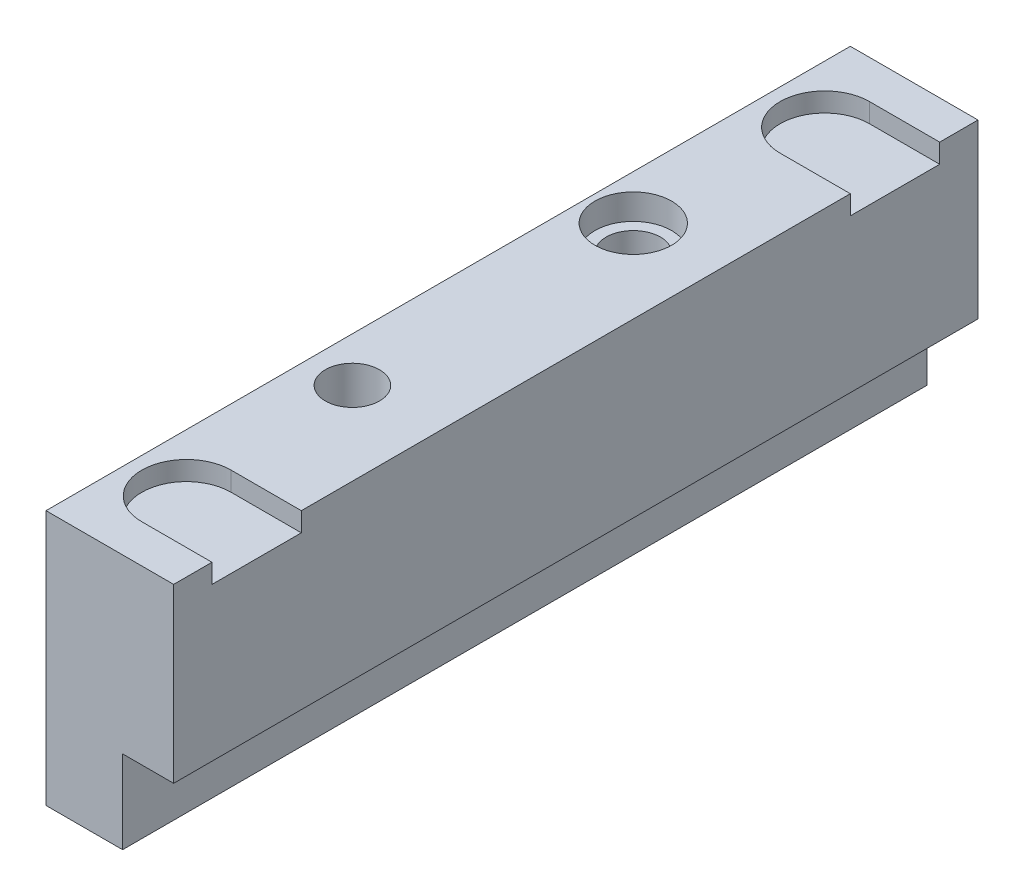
ISO-10303-21;
HEADER;
FILE_DESCRIPTION(('STEP AP214'),'2;1');
FILE_NAME('part.step','',(''),(''),'','','');
FILE_SCHEMA(('AUTOMOTIVE_DESIGN { 1 0 10303 214 1 1 1 1 }'));
ENDSEC;
DATA;
#1=APPLICATION_CONTEXT('core data for automotive mechanical design processes');
#2=APPLICATION_PROTOCOL_DEFINITION('international standard','automotive_design',2000,#1);
#3=PRODUCT_CONTEXT('',#1,'mechanical');
#4=PRODUCT('Part','Part','',(#3));
#5=PRODUCT_RELATED_PRODUCT_CATEGORY('part','',(#4));
#6=PRODUCT_DEFINITION_FORMATION('','',#4);
#7=PRODUCT_DEFINITION_CONTEXT('part definition',#1,'design');
#8=PRODUCT_DEFINITION('design','',#6,#7);
#9=PRODUCT_DEFINITION_SHAPE('','',#8);
#10=(LENGTH_UNIT() NAMED_UNIT(*) SI_UNIT(.MILLI.,.METRE.));
#11=(NAMED_UNIT(*) PLANE_ANGLE_UNIT() SI_UNIT($,.RADIAN.));
#12=(NAMED_UNIT(*) SI_UNIT($,.STERADIAN.) SOLID_ANGLE_UNIT());
#13=UNCERTAINTY_MEASURE_WITH_UNIT(LENGTH_MEASURE(1.E-05),#10,'distance_accuracy_value','');
#14=(GEOMETRIC_REPRESENTATION_CONTEXT(3) GLOBAL_UNCERTAINTY_ASSIGNED_CONTEXT((#13)) GLOBAL_UNIT_ASSIGNED_CONTEXT((#10,
#11,#12)) REPRESENTATION_CONTEXT('',''));
#15=CARTESIAN_POINT('',(0.,0.,0.));
#16=DIRECTION('',(0.,0.,1.));
#17=DIRECTION('',(1.,0.,0.));
#18=AXIS2_PLACEMENT_3D('',#15,#16,#17);
#19=CARTESIAN_POINT('',(87.3125,-63.5,100.0125));
#20=DIRECTION('',(0.,-1.,0.));
#21=DIRECTION('',(0.,0.,-1.));
#22=AXIS2_PLACEMENT_3D('',#19,#20,#21);
#23=PLANE('',#22);
#24=CARTESIAN_POINT('',(79.375,-63.4999999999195,79.375));
#25=DIRECTION('',(0.,-1.,0.));
#26=DIRECTION('',(0.,0.,-1.));
#27=AXIS2_PLACEMENT_3D('',#24,#25,#26);
#28=CIRCLE('',#27,5.35813);
#29=CARTESIAN_POINT('',(79.375,-63.4999999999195,74.01687));
#30=VERTEX_POINT('',#29);
#31=EDGE_CURVE('E202',#30,#30,#28,.T.);
#32=ORIENTED_EDGE('',*,*,#31,.F.);
#33=EDGE_LOOP('',(#32));
#34=FACE_BOUND('',#33,.T.);
#35=CARTESIAN_POINT('',(79.375,-63.5000000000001,-79.375));
#36=DIRECTION('',(0.,-1.,0.));
#37=DIRECTION('',(0.,0.,-1.));
#38=AXIS2_PLACEMENT_3D('',#35,#36,#37);
#39=CIRCLE('',#38,5.35813);
#40=CARTESIAN_POINT('',(79.375,-63.5000000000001,-84.73313));
#41=VERTEX_POINT('',#40);
#42=EDGE_CURVE('E213',#41,#41,#39,.T.);
#43=ORIENTED_EDGE('',*,*,#42,.F.);
#44=EDGE_LOOP('',(#43));
#45=FACE_BOUND('',#44,.T.);
#46=CARTESIAN_POINT('',(79.375,-63.5000000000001,-57.15));
#47=DIRECTION('',(0.,-1.,0.));
#48=DIRECTION('',(0.,0.,-1.));
#49=AXIS2_PLACEMENT_3D('',#46,#47,#48);
#50=CIRCLE('',#49,6.3627);
#51=CARTESIAN_POINT('',(79.375,-63.5000000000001,-63.5127));
#52=VERTEX_POINT('',#51);
#53=EDGE_CURVE('E228',#52,#52,#50,.T.);
#54=ORIENTED_EDGE('',*,*,#53,.F.);
#55=EDGE_LOOP('',(#54));
#56=FACE_BOUND('',#55,.T.);
#57=CARTESIAN_POINT('',(79.375,-63.5000000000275,34.925));
#58=DIRECTION('',(0.,-1.,0.));
#59=DIRECTION('',(1.,0.,0.));
#60=AXIS2_PLACEMENT_3D('',#57,#58,#59);
#61=CIRCLE('',#60,6.74369999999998);
#62=CARTESIAN_POINT('',(86.1187,-63.5000000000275,34.925));
#63=VERTEX_POINT('',#62);
#64=EDGE_CURVE('E241',#63,#63,#61,.T.);
#65=ORIENTED_EDGE('',*,*,#64,.F.);
#66=EDGE_LOOP('',(#65));
#67=FACE_BOUND('',#66,.T.);
#68=CARTESIAN_POINT('',(79.375,-63.5000000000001,-34.925));
#69=DIRECTION('',(0.,-1.,0.));
#70=DIRECTION('',(1.,0.,0.));
#71=AXIS2_PLACEMENT_3D('',#68,#69,#70);
#72=CIRCLE('',#71,6.74369999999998);
#73=CARTESIAN_POINT('',(86.1187,-63.5000000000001,-34.925));
#74=VERTEX_POINT('',#73);
#75=EDGE_CURVE('E240',#74,#74,#72,.T.);
#76=ORIENTED_EDGE('',*,*,#75,.F.);
#77=EDGE_LOOP('',(#76));
#78=FACE_BOUND('',#77,.T.);
#79=DIRECTION('',(-1.,0.,0.));
#80=VECTOR('',#79,1.);
#81=CARTESIAN_POINT('',(87.3125,-63.5,-100.0125));
#82=LINE('',#81,#80);
#83=CARTESIAN_POINT('',(87.3125,-63.5,-100.0125));
#84=VERTEX_POINT('',#83);
#85=CARTESIAN_POINT('',(68.2625,-63.5,-100.0125));
#86=VERTEX_POINT('',#85);
#87=EDGE_CURVE('E251',#84,#86,#82,.T.);
#88=ORIENTED_EDGE('',*,*,#87,.F.);
#89=DIRECTION('',(0.,0.,-1.));
#90=VECTOR('',#89,1.);
#91=CARTESIAN_POINT('',(87.3125,-63.5,100.0125));
#92=LINE('',#91,#90);
#93=CARTESIAN_POINT('',(87.3125,-63.5,100.0125));
#94=VERTEX_POINT('',#93);
#95=EDGE_CURVE('E262',#94,#84,#92,.T.);
#96=ORIENTED_EDGE('',*,*,#95,.F.);
#97=DIRECTION('',(-1.,0.,0.));
#98=VECTOR('',#97,1.);
#99=CARTESIAN_POINT('',(87.3125,-63.5,100.0125));
#100=LINE('',#99,#98);
#101=CARTESIAN_POINT('',(68.2625,-63.5,100.0125));
#102=VERTEX_POINT('',#101);
#103=EDGE_CURVE('E259',#94,#102,#100,.T.);
#104=ORIENTED_EDGE('',*,*,#103,.T.);
#105=DIRECTION('',(0.,0.,-1.));
#106=VECTOR('',#105,1.);
#107=CARTESIAN_POINT('',(68.2625,-63.5,100.0125));
#108=LINE('',#107,#106);
#109=EDGE_CURVE('E277',#102,#86,#108,.T.);
#110=ORIENTED_EDGE('',*,*,#109,.T.);
#111=EDGE_LOOP('',(#88,#96,#104,#110));
#112=FACE_BOUND('',#111,.T.);
#113=CARTESIAN_POINT('',(79.375,-63.4999999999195,57.15));
#114=DIRECTION('',(0.,-1.,0.));
#115=DIRECTION('',(0.,0.,-1.));
#116=AXIS2_PLACEMENT_3D('',#113,#114,#115);
#117=CIRCLE('',#116,6.3627);
#118=CARTESIAN_POINT('',(79.375,-63.4999999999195,50.7873));
#119=VERTEX_POINT('',#118);
#120=EDGE_CURVE('E222',#119,#119,#117,.T.);
#121=ORIENTED_EDGE('',*,*,#120,.F.);
#122=EDGE_LOOP('',(#121));
#123=FACE_BOUND('',#122,.T.);
#124=ADVANCED_FACE('F36',(#34,#45,#56,#67,#78,#112,#123),#23,.T.);
#125=CARTESIAN_POINT('',(79.375,0.,-34.925));
#126=DIRECTION('',(0.,-1.,0.));
#127=DIRECTION('',(1.,0.,0.));
#128=AXIS2_PLACEMENT_3D('',#125,#126,#127);
#129=CYLINDRICAL_SURFACE('',#128,6.74369999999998);
#130=ORIENTED_EDGE('',*,*,#75,.T.);
#131=EDGE_LOOP('',(#130));
#132=FACE_BOUND('',#131,.T.);
#133=CARTESIAN_POINT('',(79.375,-6.35000000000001,-34.925));
#134=DIRECTION('',(0.,1.,0.));
#135=DIRECTION('',(-1.,0.,0.));
#136=AXIS2_PLACEMENT_3D('',#133,#134,#135);
#137=CIRCLE('',#136,6.74369999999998);
#138=CARTESIAN_POINT('',(72.6313000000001,-6.35000000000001,-34.925));
#139=VERTEX_POINT('',#138);
#140=EDGE_CURVE('E40',#139,#139,#137,.F.);
#141=ORIENTED_EDGE('',*,*,#140,.F.);
#142=EDGE_LOOP('',(#141));
#143=FACE_BOUND('',#142,.T.);
#144=ADVANCED_FACE('F344',(#132,#143),#129,.F.);
#145=CARTESIAN_POINT('',(87.3125,-63.5,100.0125));
#146=DIRECTION('',(-1.,0.,0.));
#147=DIRECTION('',(0.,0.,1.));
#148=AXIS2_PLACEMENT_3D('',#145,#146,#147);
#149=PLANE('',#148);
#150=DIRECTION('',(0.,1.,0.));
#151=VECTOR('',#150,1.);
#152=CARTESIAN_POINT('',(87.3125,-63.5,-100.0125));
#153=LINE('',#152,#151);
#154=CARTESIAN_POINT('',(87.3125,-42.8498,-100.0125));
#155=VERTEX_POINT('',#154);
#156=EDGE_CURVE('E246',#84,#155,#153,.T.);
#157=ORIENTED_EDGE('',*,*,#156,.T.);
#158=DIRECTION('',(0.,0.,-1.));
#159=VECTOR('',#158,1.);
#160=CARTESIAN_POINT('',(87.3125,-42.8498,100.0125));
#161=LINE('',#160,#159);
#162=CARTESIAN_POINT('',(87.3125,-42.8498,100.0125));
#163=VERTEX_POINT('',#162);
#164=EDGE_CURVE('E11',#163,#155,#161,.T.);
#165=ORIENTED_EDGE('',*,*,#164,.F.);
#166=DIRECTION('',(0.,1.,0.));
#167=VECTOR('',#166,1.);
#168=CARTESIAN_POINT('',(87.3125,-63.5,100.0125));
#169=LINE('',#168,#167);
#170=EDGE_CURVE('E247',#94,#163,#169,.T.);
#171=ORIENTED_EDGE('',*,*,#170,.F.);
#172=ORIENTED_EDGE('',*,*,#95,.T.);
#173=EDGE_LOOP('',(#157,#165,#171,#172));
#174=FACE_BOUND('',#173,.T.);
#175=ADVANCED_FACE('F38',(#174),#149,.F.);
#176=CARTESIAN_POINT('',(87.3125,-42.8498,100.0125));
#177=DIRECTION('',(0.,1.,0.));
#178=DIRECTION('',(0.,0.,1.));
#179=AXIS2_PLACEMENT_3D('',#176,#177,#178);
#180=PLANE('',#179);
#181=DIRECTION('',(1.,0.,0.));
#182=VECTOR('',#181,1.);
#183=CARTESIAN_POINT('',(87.3125,-42.8498,-100.0125));
#184=LINE('',#183,#182);
#185=CARTESIAN_POINT('',(100.0125,-42.8498,-100.0125));
#186=VERTEX_POINT('',#185);
#187=EDGE_CURVE('E265',#155,#186,#184,.T.);
#188=ORIENTED_EDGE('',*,*,#187,.T.);
#189=DIRECTION('',(0.,0.,-1.));
#190=VECTOR('',#189,1.);
#191=CARTESIAN_POINT('',(100.0125,-42.8498,100.0125));
#192=LINE('',#191,#190);
#193=CARTESIAN_POINT('',(100.0125,-42.8498,100.0125));
#194=VERTEX_POINT('',#193);
#195=EDGE_CURVE('E45',#194,#186,#192,.T.);
#196=ORIENTED_EDGE('',*,*,#195,.F.);
#197=DIRECTION('',(1.,0.,0.));
#198=VECTOR('',#197,1.);
#199=CARTESIAN_POINT('',(87.3125,-42.8498,100.0125));
#200=LINE('',#199,#198);
#201=EDGE_CURVE('E250',#163,#194,#200,.T.);
#202=ORIENTED_EDGE('',*,*,#201,.F.);
#203=ORIENTED_EDGE('',*,*,#164,.T.);
#204=EDGE_LOOP('',(#188,#196,#202,#203));
#205=FACE_BOUND('',#204,.T.);
#206=ADVANCED_FACE('F363',(#205),#180,.F.);
#207=CARTESIAN_POINT('',(100.0125,-42.8498,100.0125));
#208=DIRECTION('',(-1.,0.,0.));
#209=DIRECTION('',(0.,0.,1.));
#210=AXIS2_PLACEMENT_3D('',#207,#208,#209);
#211=PLANE('',#210);
#212=DIRECTION('',(0.,0.,-1.));
#213=VECTOR('',#212,1.);
#214=CARTESIAN_POINT('',(100.0125,-4.77519999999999,-90.4875));
#215=LINE('',#214,#213);
#216=CARTESIAN_POINT('',(100.0125,-4.77519999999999,-68.2625));
#217=VERTEX_POINT('',#216);
#218=CARTESIAN_POINT('',(100.0125,-4.77519999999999,-90.4875));
#219=VERTEX_POINT('',#218);
#220=EDGE_CURVE('E158',#217,#219,#215,.T.);
#221=ORIENTED_EDGE('',*,*,#220,.F.);
#222=DIRECTION('',(0.,1.,0.));
#223=VECTOR('',#222,1.);
#224=CARTESIAN_POINT('',(100.0125,-4.77519999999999,-68.2625));
#225=LINE('',#224,#223);
#226=CARTESIAN_POINT('',(100.0125,0.,-68.2625));
#227=VERTEX_POINT('',#226);
#228=EDGE_CURVE('E195',#217,#227,#225,.T.);
#229=ORIENTED_EDGE('',*,*,#228,.T.);
#230=DIRECTION('',(0.,0.,-1.));
#231=VECTOR('',#230,1.);
#232=CARTESIAN_POINT('',(100.0125,0.,100.0125));
#233=LINE('',#232,#231);
#234=CARTESIAN_POINT('',(100.0125,0.,68.2625));
#235=VERTEX_POINT('',#234);
#236=EDGE_CURVE('E285',#235,#227,#233,.T.);
#237=ORIENTED_EDGE('',*,*,#236,.F.);
#238=DIRECTION('',(0.,1.,0.));
#239=VECTOR('',#238,1.);
#240=CARTESIAN_POINT('',(100.0125,-4.77519999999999,68.2625));
#241=LINE('',#240,#239);
#242=CARTESIAN_POINT('',(100.0125,-4.77519999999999,68.2625));
#243=VERTEX_POINT('',#242);
#244=EDGE_CURVE('E60',#243,#235,#241,.T.);
#245=ORIENTED_EDGE('',*,*,#244,.F.);
#246=DIRECTION('',(0.,0.,-1.));
#247=VECTOR('',#246,1.);
#248=CARTESIAN_POINT('',(100.0125,-4.77519999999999,68.2625));
#249=LINE('',#248,#247);
#250=CARTESIAN_POINT('',(100.0125,-4.77519999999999,90.4875));
#251=VERTEX_POINT('',#250);
#252=EDGE_CURVE('E179',#251,#243,#249,.T.);
#253=ORIENTED_EDGE('',*,*,#252,.F.);
#254=DIRECTION('',(0.,1.,0.));
#255=VECTOR('',#254,1.);
#256=CARTESIAN_POINT('',(100.0125,-4.77519999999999,90.4875));
#257=LINE('',#256,#255);
#258=CARTESIAN_POINT('',(100.0125,0.,90.4875));
#259=VERTEX_POINT('',#258);
#260=EDGE_CURVE('E199',#251,#259,#257,.T.);
#261=ORIENTED_EDGE('',*,*,#260,.T.);
#262=CARTESIAN_POINT('',(100.0125,0.,100.0125));
#263=VERTEX_POINT('',#262);
#264=EDGE_CURVE('E282',#263,#259,#233,.T.);
#265=ORIENTED_EDGE('',*,*,#264,.F.);
#266=DIRECTION('',(0.,1.,0.));
#267=VECTOR('',#266,1.);
#268=CARTESIAN_POINT('',(100.0125,-42.8498,100.0125));
#269=LINE('',#268,#267);
#270=EDGE_CURVE('E253',#194,#263,#269,.T.);
#271=ORIENTED_EDGE('',*,*,#270,.F.);
#272=ORIENTED_EDGE('',*,*,#195,.T.);
#273=DIRECTION('',(0.,1.,0.));
#274=VECTOR('',#273,1.);
#275=CARTESIAN_POINT('',(100.0125,-42.8498,-100.0125));
#276=LINE('',#275,#274);
#277=CARTESIAN_POINT('',(100.0125,0.,-100.0125));
#278=VERTEX_POINT('',#277);
#279=EDGE_CURVE('E267',#186,#278,#276,.T.);
#280=ORIENTED_EDGE('',*,*,#279,.T.);
#281=CARTESIAN_POINT('',(100.0125,0.,-90.4875));
#282=VERTEX_POINT('',#281);
#283=EDGE_CURVE('E172',#282,#278,#233,.T.);
#284=ORIENTED_EDGE('',*,*,#283,.F.);
#285=DIRECTION('',(0.,1.,0.));
#286=VECTOR('',#285,1.);
#287=CARTESIAN_POINT('',(100.0125,-4.77519999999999,-90.4875));
#288=LINE('',#287,#286);
#289=EDGE_CURVE('E52',#219,#282,#288,.T.);
#290=ORIENTED_EDGE('',*,*,#289,.F.);
#291=EDGE_LOOP('',(#221,#229,#237,#245,#253,#261,#265,#271,#272,#280,#284,#290));
#292=FACE_BOUND('',#291,.T.);
#293=ADVANCED_FACE('F170',(#292),#211,.F.);
#294=CARTESIAN_POINT('',(100.0125,0.,100.0125));
#295=DIRECTION('',(0.,-1.,0.));
#296=DIRECTION('',(1.,0.,0.));
#297=AXIS2_PLACEMENT_3D('',#294,#295,#296);
#298=PLANE('',#297);
#299=CARTESIAN_POINT('',(79.375,0.,-34.925));
#300=DIRECTION('',(0.,1.,0.));
#301=DIRECTION('',(-1.,0.,0.));
#302=AXIS2_PLACEMENT_3D('',#299,#300,#301);
#303=CIRCLE('',#302,9.53135000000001);
#304=CARTESIAN_POINT('',(69.84365,0.,-34.925));
#305=VERTEX_POINT('',#304);
#306=EDGE_CURVE('E231',#305,#305,#303,.T.);
#307=ORIENTED_EDGE('',*,*,#306,.F.);
#308=EDGE_LOOP('',(#307));
#309=FACE_BOUND('',#308,.T.);
#310=CARTESIAN_POINT('',(79.375,0.,34.925));
#311=DIRECTION('',(0.,-1.,0.));
#312=DIRECTION('',(1.,0.,0.));
#313=AXIS2_PLACEMENT_3D('',#310,#311,#312);
#314=CIRCLE('',#313,6.74369999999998);
#315=CARTESIAN_POINT('',(86.1187,0.,34.925));
#316=VERTEX_POINT('',#315);
#317=EDGE_CURVE('E237',#316,#316,#314,.T.);
#318=ORIENTED_EDGE('',*,*,#317,.T.);
#319=EDGE_LOOP('',(#318));
#320=FACE_BOUND('',#319,.T.);
#321=ORIENTED_EDGE('',*,*,#236,.T.);
#322=DIRECTION('',(1.,0.,0.));
#323=VECTOR('',#322,1.);
#324=CARTESIAN_POINT('',(100.0125,0.,-68.2625));
#325=LINE('',#324,#323);
#326=CARTESIAN_POINT('',(82.55,0.,-68.2625));
#327=VERTEX_POINT('',#326);
#328=EDGE_CURVE('E167',#327,#227,#325,.T.);
#329=ORIENTED_EDGE('',*,*,#328,.F.);
#330=CARTESIAN_POINT('',(82.55,0.,-79.375));
#331=DIRECTION('',(0.,1.,0.));
#332=DIRECTION('',(1.,0.,0.));
#333=AXIS2_PLACEMENT_3D('',#330,#331,#332);
#334=CIRCLE('',#333,11.1125);
#335=CARTESIAN_POINT('',(82.55,0.,-90.4875));
#336=VERTEX_POINT('',#335);
#337=EDGE_CURVE('E326',#336,#327,#334,.T.);
#338=ORIENTED_EDGE('',*,*,#337,.F.);
#339=DIRECTION('',(-1.,0.,0.));
#340=VECTOR('',#339,1.);
#341=CARTESIAN_POINT('',(82.55,0.,-90.4875));
#342=LINE('',#341,#340);
#343=EDGE_CURVE('E329',#282,#336,#342,.T.);
#344=ORIENTED_EDGE('',*,*,#343,.F.);
#345=ORIENTED_EDGE('',*,*,#283,.T.);
#346=DIRECTION('',(-1.,0.,0.));
#347=VECTOR('',#346,1.);
#348=CARTESIAN_POINT('',(100.0125,0.,-100.0125));
#349=LINE('',#348,#347);
#350=CARTESIAN_POINT('',(68.2625,0.,-100.0125));
#351=VERTEX_POINT('',#350);
#352=EDGE_CURVE('E269',#278,#351,#349,.T.);
#353=ORIENTED_EDGE('',*,*,#352,.T.);
#354=DIRECTION('',(0.,0.,-1.));
#355=VECTOR('',#354,1.);
#356=CARTESIAN_POINT('',(68.2625,0.,100.0125));
#357=LINE('',#356,#355);
#358=CARTESIAN_POINT('',(68.2625,0.,100.0125));
#359=VERTEX_POINT('',#358);
#360=EDGE_CURVE('E279',#359,#351,#357,.T.);
#361=ORIENTED_EDGE('',*,*,#360,.F.);
#362=DIRECTION('',(-1.,0.,0.));
#363=VECTOR('',#362,1.);
#364=CARTESIAN_POINT('',(100.0125,0.,100.0125));
#365=LINE('',#364,#363);
#366=EDGE_CURVE('E255',#263,#359,#365,.T.);
#367=ORIENTED_EDGE('',*,*,#366,.F.);
#368=ORIENTED_EDGE('',*,*,#264,.T.);
#369=DIRECTION('',(1.,0.,0.));
#370=VECTOR('',#369,1.);
#371=CARTESIAN_POINT('',(100.0125,0.,90.4875));
#372=LINE('',#371,#370);
#373=CARTESIAN_POINT('',(82.55,0.,90.4875));
#374=VERTEX_POINT('',#373);
#375=EDGE_CURVE('E183',#374,#259,#372,.T.);
#376=ORIENTED_EDGE('',*,*,#375,.F.);
#377=CARTESIAN_POINT('',(82.55,0.,79.375));
#378=DIRECTION('',(0.,1.,0.));
#379=DIRECTION('',(1.,0.,0.));
#380=AXIS2_PLACEMENT_3D('',#377,#378,#379);
#381=CIRCLE('',#380,11.1125);
#382=CARTESIAN_POINT('',(82.55,0.,68.2625));
#383=VERTEX_POINT('',#382);
#384=EDGE_CURVE('E194',#383,#374,#381,.T.);
#385=ORIENTED_EDGE('',*,*,#384,.F.);
#386=DIRECTION('',(-1.,0.,0.));
#387=VECTOR('',#386,1.);
#388=CARTESIAN_POINT('',(82.55,0.,68.2625));
#389=LINE('',#388,#387);
#390=EDGE_CURVE('E192',#235,#383,#389,.T.);
#391=ORIENTED_EDGE('',*,*,#390,.F.);
#392=EDGE_LOOP('',(#321,#329,#338,#344,#345,#353,#361,#367,#368,#376,#385,#391));
#393=FACE_BOUND('',#392,.T.);
#394=ADVANCED_FACE('F300',(#309,#320,#393),#298,.F.);
#395=CARTESIAN_POINT('',(68.2625,0.,100.0125));
#396=DIRECTION('',(1.,0.,0.));
#397=DIRECTION('',(0.,1.,0.));
#398=AXIS2_PLACEMENT_3D('',#395,#396,#397);
#399=PLANE('',#398);
#400=DIRECTION('',(0.,-1.,0.));
#401=VECTOR('',#400,1.);
#402=CARTESIAN_POINT('',(68.2625,0.,-100.0125));
#403=LINE('',#402,#401);
#404=EDGE_CURVE('E271',#351,#86,#403,.T.);
#405=ORIENTED_EDGE('',*,*,#404,.T.);
#406=ORIENTED_EDGE('',*,*,#109,.F.);
#407=DIRECTION('',(0.,-1.,0.));
#408=VECTOR('',#407,1.);
#409=CARTESIAN_POINT('',(68.2625,0.,100.0125));
#410=LINE('',#409,#408);
#411=EDGE_CURVE('E257',#359,#102,#410,.T.);
#412=ORIENTED_EDGE('',*,*,#411,.F.);
#413=ORIENTED_EDGE('',*,*,#360,.T.);
#414=EDGE_LOOP('',(#405,#406,#412,#413));
#415=FACE_BOUND('',#414,.T.);
#416=ADVANCED_FACE('F304',(#415),#399,.F.);
#417=CARTESIAN_POINT('',(87.3125,-42.8498,100.0125));
#418=DIRECTION('',(0.,0.,-1.));
#419=DIRECTION('',(-1.,0.,0.));
#420=AXIS2_PLACEMENT_3D('',#417,#418,#419);
#421=PLANE('',#420);
#422=ORIENTED_EDGE('',*,*,#170,.T.);
#423=ORIENTED_EDGE('',*,*,#201,.T.);
#424=ORIENTED_EDGE('',*,*,#270,.T.);
#425=ORIENTED_EDGE('',*,*,#366,.T.);
#426=ORIENTED_EDGE('',*,*,#411,.T.);
#427=ORIENTED_EDGE('',*,*,#103,.F.);
#428=EDGE_LOOP('',(#422,#423,#424,#425,#426,#427));
#429=FACE_BOUND('',#428,.T.);
#430=ADVANCED_FACE('F308',(#429),#421,.F.);
#431=CARTESIAN_POINT('',(87.3125,-42.8498,-100.0125));
#432=DIRECTION('',(0.,0.,-1.));
#433=DIRECTION('',(-1.,0.,0.));
#434=AXIS2_PLACEMENT_3D('',#431,#432,#433);
#435=PLANE('',#434);
#436=ORIENTED_EDGE('',*,*,#156,.F.);
#437=ORIENTED_EDGE('',*,*,#87,.T.);
#438=ORIENTED_EDGE('',*,*,#404,.F.);
#439=ORIENTED_EDGE('',*,*,#352,.F.);
#440=ORIENTED_EDGE('',*,*,#279,.F.);
#441=ORIENTED_EDGE('',*,*,#187,.F.);
#442=EDGE_LOOP('',(#436,#437,#438,#439,#440,#441));
#443=FACE_BOUND('',#442,.T.);
#444=ADVANCED_FACE('F295',(#443),#435,.T.);
#445=CARTESIAN_POINT('',(79.375,0.,34.925));
#446=DIRECTION('',(0.,-1.,0.));
#447=DIRECTION('',(1.,0.,0.));
#448=AXIS2_PLACEMENT_3D('',#445,#446,#447);
#449=CYLINDRICAL_SURFACE('',#448,6.74369999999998);
#450=ORIENTED_EDGE('',*,*,#317,.F.);
#451=EDGE_LOOP('',(#450));
#452=FACE_BOUND('',#451,.T.);
#453=ORIENTED_EDGE('',*,*,#64,.T.);
#454=EDGE_LOOP('',(#453));
#455=FACE_BOUND('',#454,.T.);
#456=ADVANCED_FACE('F407',(#452,#455),#449,.F.);
#457=CARTESIAN_POINT('',(79.375,-6.35000000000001,-34.925));
#458=DIRECTION('',(0.,1.,0.));
#459=DIRECTION('',(-1.,0.,0.));
#460=AXIS2_PLACEMENT_3D('',#457,#458,#459);
#461=PLANE('',#460);
#462=CARTESIAN_POINT('',(79.375,-6.35000000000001,-34.925));
#463=DIRECTION('',(0.,1.,0.));
#464=DIRECTION('',(-1.,0.,0.));
#465=AXIS2_PLACEMENT_3D('',#462,#463,#464);
#466=CIRCLE('',#465,9.53135000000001);
#467=CARTESIAN_POINT('',(69.84365,-6.35000000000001,-34.925));
#468=VERTEX_POINT('',#467);
#469=EDGE_CURVE('E232',#468,#468,#466,.T.);
#470=ORIENTED_EDGE('',*,*,#469,.T.);
#471=EDGE_LOOP('',(#470));
#472=FACE_BOUND('',#471,.T.);
#473=ORIENTED_EDGE('',*,*,#140,.T.);
#474=EDGE_LOOP('',(#473));
#475=FACE_BOUND('',#474,.T.);
#476=ADVANCED_FACE('F404',(#472,#475),#461,.T.);
#477=CARTESIAN_POINT('',(79.375,-6.35000000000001,-34.925));
#478=DIRECTION('',(0.,1.,0.));
#479=DIRECTION('',(-1.,0.,0.));
#480=AXIS2_PLACEMENT_3D('',#477,#478,#479);
#481=CYLINDRICAL_SURFACE('',#480,9.53135000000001);
#482=ORIENTED_EDGE('',*,*,#469,.F.);
#483=EDGE_LOOP('',(#482));
#484=FACE_BOUND('',#483,.T.);
#485=ORIENTED_EDGE('',*,*,#306,.T.);
#486=EDGE_LOOP('',(#485));
#487=FACE_BOUND('',#486,.T.);
#488=ADVANCED_FACE('F402',(#484,#487),#481,.F.);
#489=CARTESIAN_POINT('',(79.375,-63.5000000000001,-57.15));
#490=DIRECTION('',(0.,-1.,0.));
#491=DIRECTION('',(0.,0.,-1.));
#492=AXIS2_PLACEMENT_3D('',#489,#490,#491);
#493=CYLINDRICAL_SURFACE('',#492,6.3627);
#494=ORIENTED_EDGE('',*,*,#53,.T.);
#495=EDGE_LOOP('',(#494));
#496=FACE_BOUND('',#495,.T.);
#497=CARTESIAN_POINT('',(79.375,-47.4980000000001,-57.15));
#498=DIRECTION('',(0.,-1.,0.));
#499=DIRECTION('',(0.,0.,-1.));
#500=AXIS2_PLACEMENT_3D('',#497,#498,#499);
#501=CIRCLE('',#500,6.3627);
#502=CARTESIAN_POINT('',(79.375,-47.4980000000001,-63.5127));
#503=VERTEX_POINT('',#502);
#504=EDGE_CURVE('E225',#503,#503,#501,.T.);
#505=ORIENTED_EDGE('',*,*,#504,.F.);
#506=EDGE_LOOP('',(#505));
#507=FACE_BOUND('',#506,.T.);
#508=ADVANCED_FACE('F398',(#496,#507),#493,.F.);
#509=CARTESIAN_POINT('',(79.375,-43.6749041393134,-57.15));
#510=DIRECTION('',(0.,-1.,0.));
#511=DIRECTION('',(0.,0.,-1.));
#512=AXIS2_PLACEMENT_3D('',#509,#510,#511);
#513=CONICAL_SURFACE('',#512,0.,1.02974425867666);
#514=ORIENTED_EDGE('',*,*,#504,.T.);
#515=EDGE_LOOP('',(#514));
#516=FACE_BOUND('',#515,.T.);
#517=CARTESIAN_POINT('',(79.375,-43.6749041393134,-57.15));
#518=VERTEX_POINT('',#517);
#519=VERTEX_LOOP('',#518);
#520=FACE_BOUND('',#519,.T.);
#521=ADVANCED_FACE('F380',(#516,#520),#513,.F.);
#522=CARTESIAN_POINT('',(79.375,-63.4999999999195,57.15));
#523=DIRECTION('',(0.,-1.,0.));
#524=DIRECTION('',(0.,0.,-1.));
#525=AXIS2_PLACEMENT_3D('',#522,#523,#524);
#526=CYLINDRICAL_SURFACE('',#525,6.3627);
#527=ORIENTED_EDGE('',*,*,#120,.T.);
#528=EDGE_LOOP('',(#527));
#529=FACE_BOUND('',#528,.T.);
#530=CARTESIAN_POINT('',(79.375,-47.4979999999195,57.15));
#531=DIRECTION('',(0.,-1.,0.));
#532=DIRECTION('',(0.,0.,-1.));
#533=AXIS2_PLACEMENT_3D('',#530,#531,#532);
#534=CIRCLE('',#533,6.3627);
#535=CARTESIAN_POINT('',(79.375,-47.4979999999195,50.7873));
#536=VERTEX_POINT('',#535);
#537=EDGE_CURVE('E219',#536,#536,#534,.T.);
#538=ORIENTED_EDGE('',*,*,#537,.F.);
#539=EDGE_LOOP('',(#538));
#540=FACE_BOUND('',#539,.T.);
#541=ADVANCED_FACE('F376',(#529,#540),#526,.F.);
#542=CARTESIAN_POINT('',(79.375,-43.6749041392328,57.15));
#543=DIRECTION('',(0.,-1.,0.));
#544=DIRECTION('',(0.,0.,-1.));
#545=AXIS2_PLACEMENT_3D('',#542,#543,#544);
#546=CONICAL_SURFACE('',#545,0.,1.02974425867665);
#547=ORIENTED_EDGE('',*,*,#537,.T.);
#548=EDGE_LOOP('',(#547));
#549=FACE_BOUND('',#548,.T.);
#550=CARTESIAN_POINT('',(79.375,-43.6749041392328,57.15));
#551=VERTEX_POINT('',#550);
#552=VERTEX_LOOP('',#551);
#553=FACE_BOUND('',#552,.T.);
#554=ADVANCED_FACE('F379',(#549,#553),#546,.F.);
#555=CARTESIAN_POINT('',(79.375,-36.0680000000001,-79.375));
#556=DIRECTION('',(0.,-1.,0.));
#557=DIRECTION('',(0.,0.,-1.));
#558=AXIS2_PLACEMENT_3D('',#555,#556,#557);
#559=CONICAL_SURFACE('',#558,5.35813,1.02974425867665);
#560=CARTESIAN_POINT('',(79.375,-32.8485106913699,-79.375));
#561=VERTEX_POINT('',#560);
#562=VERTEX_LOOP('',#561);
#563=FACE_BOUND('',#562,.T.);
#564=CARTESIAN_POINT('',(79.375,-36.0680000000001,-79.375));
#565=DIRECTION('',(0.,-1.,0.));
#566=DIRECTION('',(0.,0.,-1.));
#567=AXIS2_PLACEMENT_3D('',#564,#565,#566);
#568=CIRCLE('',#567,5.35813);
#569=CARTESIAN_POINT('',(79.375,-36.0680000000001,-84.73313));
#570=VERTEX_POINT('',#569);
#571=EDGE_CURVE('E216',#570,#570,#568,.T.);
#572=ORIENTED_EDGE('',*,*,#571,.T.);
#573=EDGE_LOOP('',(#572));
#574=FACE_BOUND('',#573,.T.);
#575=ADVANCED_FACE('F386',(#563,#574),#559,.F.);
#576=CARTESIAN_POINT('',(79.375,-63.5000000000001,-79.375));
#577=DIRECTION('',(0.,-1.,0.));
#578=DIRECTION('',(0.,0.,-1.));
#579=AXIS2_PLACEMENT_3D('',#576,#577,#578);
#580=CYLINDRICAL_SURFACE('',#579,5.35813);
#581=ORIENTED_EDGE('',*,*,#571,.F.);
#582=EDGE_LOOP('',(#581));
#583=FACE_BOUND('',#582,.T.);
#584=ORIENTED_EDGE('',*,*,#42,.T.);
#585=EDGE_LOOP('',(#584));
#586=FACE_BOUND('',#585,.T.);
#587=ADVANCED_FACE('F391',(#583,#586),#580,.F.);
#588=CARTESIAN_POINT('',(79.375,-36.0679999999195,79.375));
#589=DIRECTION('',(0.,-1.,0.));
#590=DIRECTION('',(0.,0.,-1.));
#591=AXIS2_PLACEMENT_3D('',#588,#589,#590);
#592=CONICAL_SURFACE('',#591,5.35813,1.02974425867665);
#593=CARTESIAN_POINT('',(79.375,-32.8485106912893,79.375));
#594=VERTEX_POINT('',#593);
#595=VERTEX_LOOP('',#594);
#596=FACE_BOUND('',#595,.T.);
#597=CARTESIAN_POINT('',(79.375,-36.0679999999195,79.375));
#598=DIRECTION('',(0.,-1.,0.));
#599=DIRECTION('',(0.,0.,-1.));
#600=AXIS2_PLACEMENT_3D('',#597,#598,#599);
#601=CIRCLE('',#600,5.35813);
#602=CARTESIAN_POINT('',(79.375,-36.0679999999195,74.01687));
#603=VERTEX_POINT('',#602);
#604=EDGE_CURVE('E210',#603,#603,#601,.T.);
#605=ORIENTED_EDGE('',*,*,#604,.T.);
#606=EDGE_LOOP('',(#605));
#607=FACE_BOUND('',#606,.T.);
#608=ADVANCED_FACE('F465',(#596,#607),#592,.F.);
#609=CARTESIAN_POINT('',(79.375,-63.4999999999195,79.375));
#610=DIRECTION('',(0.,-1.,0.));
#611=DIRECTION('',(0.,0.,-1.));
#612=AXIS2_PLACEMENT_3D('',#609,#610,#611);
#613=CYLINDRICAL_SURFACE('',#612,5.35813);
#614=ORIENTED_EDGE('',*,*,#604,.F.);
#615=EDGE_LOOP('',(#614));
#616=FACE_BOUND('',#615,.T.);
#617=ORIENTED_EDGE('',*,*,#31,.T.);
#618=EDGE_LOOP('',(#617));
#619=FACE_BOUND('',#618,.T.);
#620=ADVANCED_FACE('F479',(#616,#619),#613,.F.);
#621=CARTESIAN_POINT('',(100.0125,-4.77519999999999,90.4875));
#622=DIRECTION('',(0.,0.,1.));
#623=DIRECTION('',(1.,0.,0.));
#624=AXIS2_PLACEMENT_3D('',#621,#622,#623);
#625=PLANE('',#624);
#626=ORIENTED_EDGE('',*,*,#375,.T.);
#627=ORIENTED_EDGE('',*,*,#260,.F.);
#628=DIRECTION('',(1.,0.,0.));
#629=VECTOR('',#628,1.);
#630=CARTESIAN_POINT('',(100.0125,-4.77519999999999,90.4875));
#631=LINE('',#630,#629);
#632=CARTESIAN_POINT('',(82.55,-4.77519999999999,90.4875));
#633=VERTEX_POINT('',#632);
#634=EDGE_CURVE('E189',#633,#251,#631,.T.);
#635=ORIENTED_EDGE('',*,*,#634,.F.);
#636=DIRECTION('',(0.,1.,0.));
#637=VECTOR('',#636,1.);
#638=CARTESIAN_POINT('',(82.55,-4.77519999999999,90.4875));
#639=LINE('',#638,#637);
#640=EDGE_CURVE('E203',#633,#374,#639,.T.);
#641=ORIENTED_EDGE('',*,*,#640,.T.);
#642=EDGE_LOOP('',(#626,#627,#635,#641));
#643=FACE_BOUND('',#642,.T.);
#644=ADVANCED_FACE('F314',(#643),#625,.F.);
#645=CARTESIAN_POINT('',(82.55,-4.77519999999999,79.375));
#646=DIRECTION('',(0.,1.,0.));
#647=DIRECTION('',(-1.,0.,0.));
#648=AXIS2_PLACEMENT_3D('',#645,#646,#647);
#649=CYLINDRICAL_SURFACE('',#648,11.1125);
#650=ORIENTED_EDGE('',*,*,#384,.T.);
#651=ORIENTED_EDGE('',*,*,#640,.F.);
#652=CARTESIAN_POINT('',(82.55,-4.77519999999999,79.375));
#653=DIRECTION('',(0.,1.,0.));
#654=DIRECTION('',(1.,0.,0.));
#655=AXIS2_PLACEMENT_3D('',#652,#653,#654);
#656=CIRCLE('',#655,11.1125);
#657=CARTESIAN_POINT('',(82.55,-4.77519999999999,68.2625));
#658=VERTEX_POINT('',#657);
#659=EDGE_CURVE('E186',#658,#633,#656,.T.);
#660=ORIENTED_EDGE('',*,*,#659,.F.);
#661=DIRECTION('',(0.,1.,0.));
#662=VECTOR('',#661,1.);
#663=CARTESIAN_POINT('',(82.55,-4.77519999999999,68.2625));
#664=LINE('',#663,#662);
#665=EDGE_CURVE('E205',#658,#383,#664,.T.);
#666=ORIENTED_EDGE('',*,*,#665,.T.);
#667=EDGE_LOOP('',(#650,#651,#660,#666));
#668=FACE_BOUND('',#667,.T.);
#669=ADVANCED_FACE('F319',(#668),#649,.F.);
#670=CARTESIAN_POINT('',(82.55,-4.77519999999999,68.2625));
#671=DIRECTION('',(0.,0.,-1.));
#672=DIRECTION('',(-1.,0.,0.));
#673=AXIS2_PLACEMENT_3D('',#670,#671,#672);
#674=PLANE('',#673);
#675=ORIENTED_EDGE('',*,*,#390,.T.);
#676=ORIENTED_EDGE('',*,*,#665,.F.);
#677=DIRECTION('',(-1.,0.,0.));
#678=VECTOR('',#677,1.);
#679=CARTESIAN_POINT('',(82.55,-4.77519999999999,68.2625));
#680=LINE('',#679,#678);
#681=EDGE_CURVE('E182',#243,#658,#680,.T.);
#682=ORIENTED_EDGE('',*,*,#681,.F.);
#683=ORIENTED_EDGE('',*,*,#244,.T.);
#684=EDGE_LOOP('',(#675,#676,#682,#683));
#685=FACE_BOUND('',#684,.T.);
#686=ADVANCED_FACE('F520',(#685),#674,.F.);
#687=CARTESIAN_POINT('',(82.55,-4.77519999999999,79.375));
#688=DIRECTION('',(0.,-1.,0.));
#689=DIRECTION('',(1.,0.,0.));
#690=AXIS2_PLACEMENT_3D('',#687,#688,#689);
#691=PLANE('',#690);
#692=ORIENTED_EDGE('',*,*,#252,.T.);
#693=ORIENTED_EDGE('',*,*,#681,.T.);
#694=ORIENTED_EDGE('',*,*,#659,.T.);
#695=ORIENTED_EDGE('',*,*,#634,.T.);
#696=EDGE_LOOP('',(#692,#693,#694,#695));
#697=FACE_BOUND('',#696,.T.);
#698=ADVANCED_FACE('F316',(#697),#691,.F.);
#699=CARTESIAN_POINT('',(100.0125,-4.77519999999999,-68.2625));
#700=DIRECTION('',(0.,0.,1.));
#701=DIRECTION('',(1.,0.,0.));
#702=AXIS2_PLACEMENT_3D('',#699,#700,#701);
#703=PLANE('',#702);
#704=ORIENTED_EDGE('',*,*,#328,.T.);
#705=ORIENTED_EDGE('',*,*,#228,.F.);
#706=DIRECTION('',(1.,0.,0.));
#707=VECTOR('',#706,1.);
#708=CARTESIAN_POINT('',(100.0125,-4.77519999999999,-68.2625));
#709=LINE('',#708,#707);
#710=CARTESIAN_POINT('',(82.55,-4.77519999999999,-68.2625));
#711=VERTEX_POINT('',#710);
#712=EDGE_CURVE('E164',#711,#217,#709,.T.);
#713=ORIENTED_EDGE('',*,*,#712,.F.);
#714=DIRECTION('',(0.,1.,0.));
#715=VECTOR('',#714,1.);
#716=CARTESIAN_POINT('',(82.55,-4.77519999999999,-68.2625));
#717=LINE('',#716,#715);
#718=EDGE_CURVE('E174',#711,#327,#717,.T.);
#719=ORIENTED_EDGE('',*,*,#718,.T.);
#720=EDGE_LOOP('',(#704,#705,#713,#719));
#721=FACE_BOUND('',#720,.T.);
#722=ADVANCED_FACE('F332',(#721),#703,.F.);
#723=CARTESIAN_POINT('',(82.55,-4.77519999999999,-79.375));
#724=DIRECTION('',(0.,1.,0.));
#725=DIRECTION('',(-1.,0.,0.));
#726=AXIS2_PLACEMENT_3D('',#723,#724,#725);
#727=CYLINDRICAL_SURFACE('',#726,11.1125);
#728=ORIENTED_EDGE('',*,*,#337,.T.);
#729=ORIENTED_EDGE('',*,*,#718,.F.);
#730=CARTESIAN_POINT('',(82.55,-4.77519999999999,-79.375));
#731=DIRECTION('',(0.,1.,0.));
#732=DIRECTION('',(1.,0.,0.));
#733=AXIS2_PLACEMENT_3D('',#730,#731,#732);
#734=CIRCLE('',#733,11.1125);
#735=CARTESIAN_POINT('',(82.55,-4.77519999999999,-90.4875));
#736=VERTEX_POINT('',#735);
#737=EDGE_CURVE('E157',#736,#711,#734,.T.);
#738=ORIENTED_EDGE('',*,*,#737,.F.);
#739=DIRECTION('',(0.,1.,0.));
#740=VECTOR('',#739,1.);
#741=CARTESIAN_POINT('',(82.55,-4.77519999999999,-90.4875));
#742=LINE('',#741,#740);
#743=EDGE_CURVE('E153',#736,#336,#742,.T.);
#744=ORIENTED_EDGE('',*,*,#743,.T.);
#745=EDGE_LOOP('',(#728,#729,#738,#744));
#746=FACE_BOUND('',#745,.T.);
#747=ADVANCED_FACE('F334',(#746),#727,.F.);
#748=CARTESIAN_POINT('',(82.55,-4.77519999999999,-90.4875));
#749=DIRECTION('',(0.,0.,-1.));
#750=DIRECTION('',(-1.,0.,0.));
#751=AXIS2_PLACEMENT_3D('',#748,#749,#750);
#752=PLANE('',#751);
#753=ORIENTED_EDGE('',*,*,#343,.T.);
#754=ORIENTED_EDGE('',*,*,#743,.F.);
#755=DIRECTION('',(-1.,0.,0.));
#756=VECTOR('',#755,1.);
#757=CARTESIAN_POINT('',(82.55,-4.77519999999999,-90.4875));
#758=LINE('',#757,#756);
#759=EDGE_CURVE('E150',#219,#736,#758,.T.);
#760=ORIENTED_EDGE('',*,*,#759,.F.);
#761=ORIENTED_EDGE('',*,*,#289,.T.);
#762=EDGE_LOOP('',(#753,#754,#760,#761));
#763=FACE_BOUND('',#762,.T.);
#764=ADVANCED_FACE('F152',(#763),#752,.F.);
#765=CARTESIAN_POINT('',(82.55,-4.77519999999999,-79.375));
#766=DIRECTION('',(0.,-1.,0.));
#767=DIRECTION('',(1.,0.,0.));
#768=AXIS2_PLACEMENT_3D('',#765,#766,#767);
#769=PLANE('',#768);
#770=ORIENTED_EDGE('',*,*,#220,.T.);
#771=ORIENTED_EDGE('',*,*,#759,.T.);
#772=ORIENTED_EDGE('',*,*,#737,.T.);
#773=ORIENTED_EDGE('',*,*,#712,.T.);
#774=EDGE_LOOP('',(#770,#771,#772,#773));
#775=FACE_BOUND('',#774,.T.);
#776=ADVANCED_FACE('F162',(#775),#769,.F.);
#777=CLOSED_SHELL('',(#124,#144,#175,#206,#293,#394,#416,#430,#444,#456,#476,#488,#508,#521,
#541,#554,#575,#587,#608,#620,#644,#669,#686,#698,#722,#747,#764,#776));
#778=MANIFOLD_SOLID_BREP('B2',#777);
#779=ADVANCED_BREP_SHAPE_REPRESENTATION('',(#18,#778),#14);
#780=SHAPE_DEFINITION_REPRESENTATION(#9,#779);
ENDSEC;
END-ISO-10303-21;
